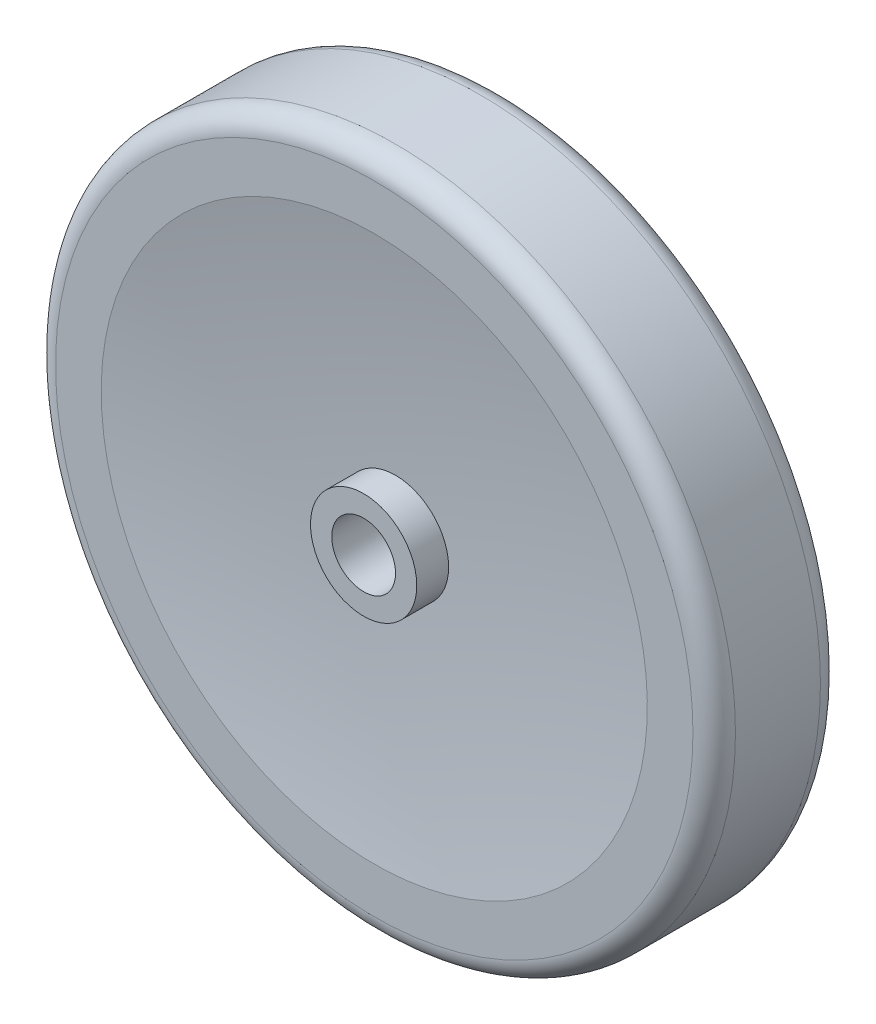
from build123d import *


with BuildPart() as part:
    # Sketch1 → Revolve1 (revolve)
    with BuildSketch(Plane(origin=(0, 0, 0), x_dir=(0, 0, -1), z_dir=(1, 0, 0)), mode=Mode.PRIVATE) as revolve1_sk:
        with BuildLine():
            Line((6.35, 50.8), (-6.35, 50.8))
            ThreePointArc((-6.35, 50.8), (-8.59506403, 49.87006403), (-9.525, 47.625))
            Line((-9.525, 47.625), (-9.525, 40.804847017))
            ThreePointArc((-9.525, 40.804847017), (-7.402834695, 24.422822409), (-6.35, 7.9375))
            Line((-6.35, 7.9375), (-11.1125, 7.9375))
            Line((-11.1125, 7.9375), (-11.1125, 4.7625))
            Line((-11.1125, 4.7625), (11.1125, 4.7625))
            Line((11.1125, 4.7625), (11.1125, 7.9375))
            Line((11.1125, 7.9375), (6.35, 7.9375))
            ThreePointArc((6.35, 7.9375), (7.402834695, 24.422822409), (9.525, 40.804847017))
            Line((9.525, 40.804847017), (9.525, 47.625))
            ThreePointArc((9.525, 47.625), (8.59506403, 49.87006403), (6.35, 50.8))
        make_face()
    revolve(revolve1_sk.sketch.rotate(Axis((0, 0, 26.718579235), (0, 0, -1)), 90), axis=Axis((0, 0, 26.718579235), (0, 0, -1)))


solid = part.part
